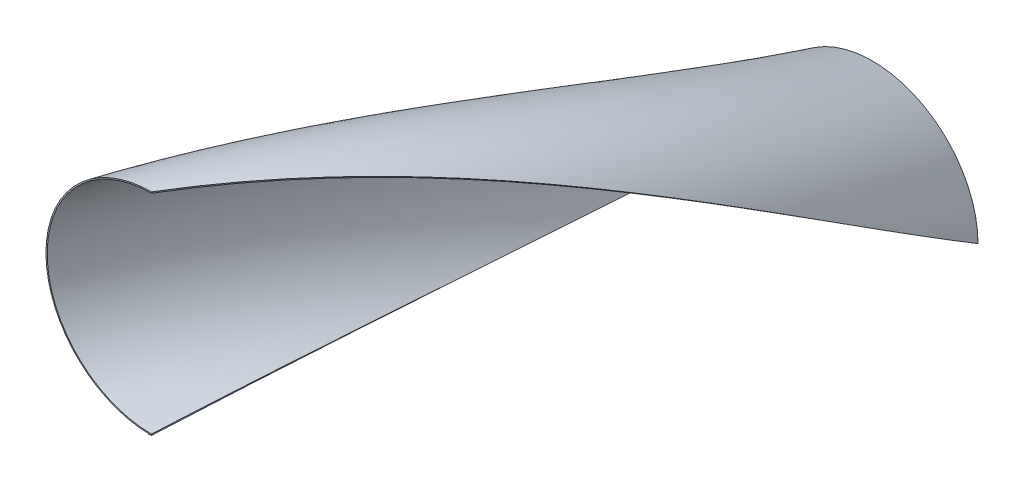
from build123d import *

# Parameters (mm, degrees)
SKETCH1_R           = 30
BOSS_EXTRUDE1_DEPTH = 1
SKETCH1_4_R         = 380
SKETCH1_4_R_2       = 30
BOSS_EXTRUDE2_DEPTH = 0.1
SWEEP5_PITCH        = 3965
SWEEP5_HEIGHT       = 991.25
SWEEP5_RADIUS       = 271.337004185
SWEEP5_START_ANGLE  = 40.25
SKETCH4_R           = 380
CUT_EXTRUDE1_DEPTH  = 0.1
SKETCH5_R           = 30
CUT_EXTRUDE2_DEPTH  = 0.1
CUT_EXTRUDE3_START  = -3
SKETCH6_R           = 30
CUT_EXTRUDE3_DEPTH  = 3


with BuildPart() as part:
    # Sketch1 → Boss-Extrude1 (new body)
    with BuildSketch(Plane.XY):
        Circle(SKETCH1_R)
    extrude(amount=BOSS_EXTRUDE1_DEPTH)

    # Sketch1_4 → Boss-Extrude2 (add)
    with BuildSketch(Plane.XY):
        Circle(SKETCH1_4_R)
        Circle(SKETCH1_4_R_2, mode=Mode.SUBTRACT)
    extrude(amount=BOSS_EXTRUDE2_DEPTH)

    # Sweep5: sweep along a helix
    with BuildLine() as sweep5_path:
        add(Helix(SWEEP5_PITCH, SWEEP5_HEIGHT, SWEEP5_RADIUS, center=(0, 0, 0.1), direction=(0, 0, 1), mode=Mode.PRIVATE).rotate(Axis((0, 0, 0.1), (0, 0, 1)), SWEEP5_START_ANGLE))
    # Sketch2 → Sweep5 (sweep)
    with BuildSketch(Plane.XY.offset(0.1)):
        with BuildLine():
            Line((30, 0), (31.986615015, 0))
            ThreePointArc((31.986615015, 0), (204.991650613, 173.005035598), (377.996686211, 0))
            Line((377.996686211, 0), (380, 0))
            ThreePointArc((380, 0), (207.37504839, 174.98388253), (30.064466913, 4.749659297))
            Line((30.064466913, 4.749659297), (29.384983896, 4.749659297))
            Line((29.384983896, 4.749659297), (30, 0))
        make_face()
    sweep(path=sweep5_path.line, is_frenet=True)

    # Sketch4 → Cut-Extrude1 (cut)
    with BuildSketch(Plane(origin=(0, 0, 0), x_dir=(-1, 0, 0), z_dir=(0, 0, -1))):
        Circle(SKETCH4_R)
    extrude(amount=-CUT_EXTRUDE1_DEPTH, mode=Mode.SUBTRACT)

    # Sketch5 → Cut-Extrude2 (cut)
    with BuildSketch(Plane(origin=(0, 0, 0.1), x_dir=(-1, 0, 0), z_dir=(0, 0, -1))):
        Circle(SKETCH5_R)
    extrude(amount=-CUT_EXTRUDE2_DEPTH, mode=Mode.SUBTRACT)

    # Sketch6 → Cut-Extrude3 (cut)
    with BuildSketch(Plane.XY.offset(1).offset(CUT_EXTRUDE3_START)):
        Circle(SKETCH6_R)
    extrude(amount=CUT_EXTRUDE3_DEPTH, mode=Mode.SUBTRACT)


solid = part.part
